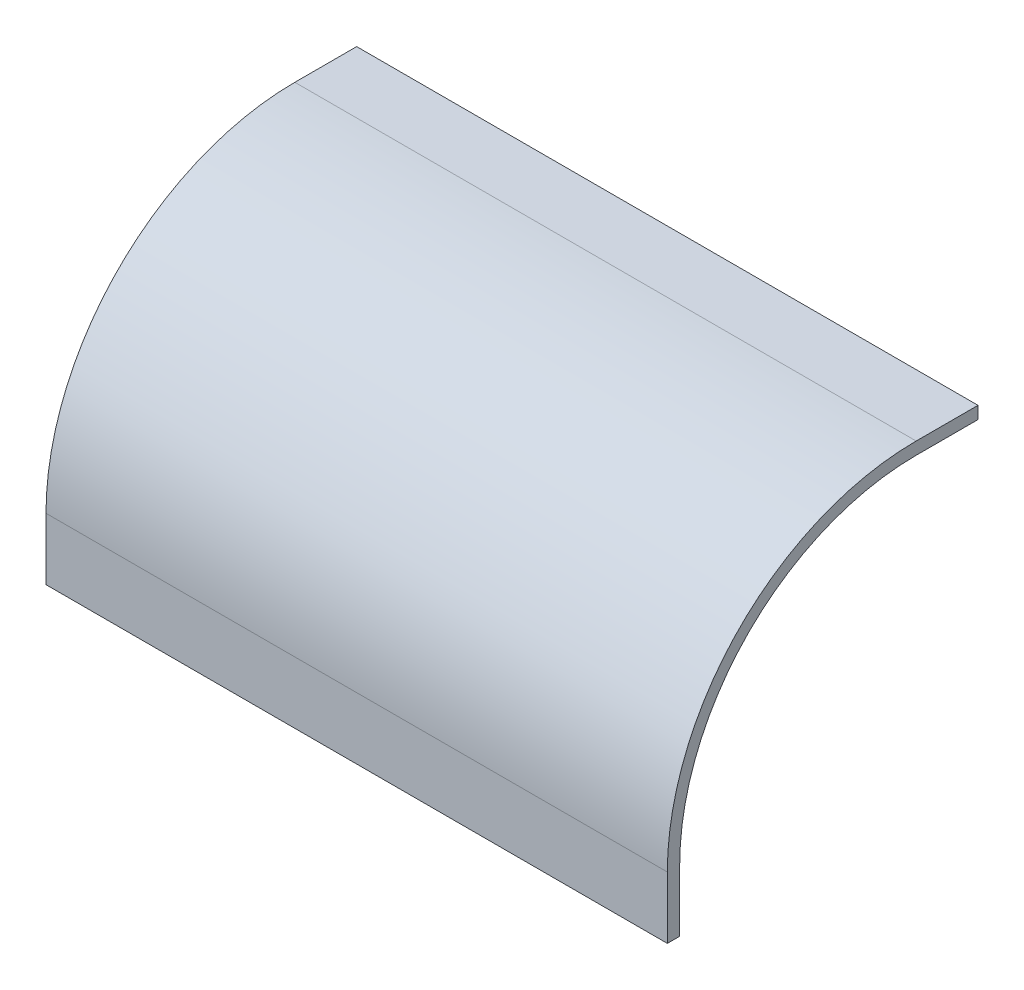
ISO-10303-21;
HEADER;
FILE_DESCRIPTION(('STEP AP214'),'2;1');
FILE_NAME('part.step','',(''),(''),'','','');
FILE_SCHEMA(('AUTOMOTIVE_DESIGN { 1 0 10303 214 1 1 1 1 }'));
ENDSEC;
DATA;
#1=APPLICATION_CONTEXT('core data for automotive mechanical design processes');
#2=APPLICATION_PROTOCOL_DEFINITION('international standard','automotive_design',2000,#1);
#3=PRODUCT_CONTEXT('',#1,'mechanical');
#4=PRODUCT('Part','Part','',(#3));
#5=PRODUCT_RELATED_PRODUCT_CATEGORY('part','',(#4));
#6=PRODUCT_DEFINITION_FORMATION('','',#4);
#7=PRODUCT_DEFINITION_CONTEXT('part definition',#1,'design');
#8=PRODUCT_DEFINITION('design','',#6,#7);
#9=PRODUCT_DEFINITION_SHAPE('','',#8);
#10=(LENGTH_UNIT() NAMED_UNIT(*) SI_UNIT(.MILLI.,.METRE.));
#11=(NAMED_UNIT(*) PLANE_ANGLE_UNIT() SI_UNIT($,.RADIAN.));
#12=(NAMED_UNIT(*) SI_UNIT($,.STERADIAN.) SOLID_ANGLE_UNIT());
#13=UNCERTAINTY_MEASURE_WITH_UNIT(LENGTH_MEASURE(1.E-05),#10,'distance_accuracy_value','');
#14=(GEOMETRIC_REPRESENTATION_CONTEXT(3) GLOBAL_UNCERTAINTY_ASSIGNED_CONTEXT((#13)) GLOBAL_UNIT_ASSIGNED_CONTEXT((#10,
#11,#12)) REPRESENTATION_CONTEXT('',''));
#15=CARTESIAN_POINT('',(0.,0.,0.));
#16=DIRECTION('',(0.,0.,1.));
#17=DIRECTION('',(1.,0.,0.));
#18=AXIS2_PLACEMENT_3D('',#15,#16,#17);
#19=CARTESIAN_POINT('',(0.,250.,-200.));
#20=DIRECTION('',(0.,-1.,0.));
#21=DIRECTION('',(1.,0.,0.));
#22=AXIS2_PLACEMENT_3D('',#19,#20,#21);
#23=PLANE('',#22);
#24=DIRECTION('',(-1.,0.,0.));
#25=VECTOR('',#24,1.);
#26=CARTESIAN_POINT('',(0.,250.,-200.));
#27=LINE('',#26,#25);
#28=CARTESIAN_POINT('',(0.,250.,-200.));
#29=VERTEX_POINT('',#28);
#30=CARTESIAN_POINT('',(-500.,250.,-200.));
#31=VERTEX_POINT('',#30);
#32=EDGE_CURVE('E152',#29,#31,#27,.T.);
#33=ORIENTED_EDGE('',*,*,#32,.T.);
#34=DIRECTION('',(0.,0.,-1.));
#35=VECTOR('',#34,1.);
#36=CARTESIAN_POINT('',(-500.,250.,-200.));
#37=LINE('',#36,#35);
#38=CARTESIAN_POINT('',(-500.,250.,-250.));
#39=VERTEX_POINT('',#38);
#40=EDGE_CURVE('E38',#31,#39,#37,.T.);
#41=ORIENTED_EDGE('',*,*,#40,.T.);
#42=DIRECTION('',(-1.,0.,0.));
#43=VECTOR('',#42,1.);
#44=CARTESIAN_POINT('',(0.,250.,-250.));
#45=LINE('',#44,#43);
#46=CARTESIAN_POINT('',(0.,250.,-250.));
#47=VERTEX_POINT('',#46);
#48=EDGE_CURVE('E45',#47,#39,#45,.T.);
#49=ORIENTED_EDGE('',*,*,#48,.F.);
#50=DIRECTION('',(0.,0.,-1.));
#51=VECTOR('',#50,1.);
#52=CARTESIAN_POINT('',(0.,250.,-200.));
#53=LINE('',#52,#51);
#54=EDGE_CURVE('E11',#29,#47,#53,.T.);
#55=ORIENTED_EDGE('',*,*,#54,.F.);
#56=EDGE_LOOP('',(#33,#41,#49,#55));
#57=FACE_BOUND('',#56,.T.);
#58=ADVANCED_FACE('F31',(#57),#23,.T.);
#59=CARTESIAN_POINT('',(-500.,241.214,-200.));
#60=DIRECTION('',(0.,-1.,0.));
#61=DIRECTION('',(0.,0.,-1.));
#62=AXIS2_PLACEMENT_3D('',#59,#60,#61);
#63=PLANE('',#62);
#64=DIRECTION('',(-1.,0.,0.));
#65=VECTOR('',#64,1.);
#66=CARTESIAN_POINT('',(-500.,241.214,-200.));
#67=LINE('',#66,#65);
#68=CARTESIAN_POINT('',(-500.,241.214,-200.));
#69=VERTEX_POINT('',#68);
#70=CARTESIAN_POINT('',(-501.214,241.214,-200.));
#71=VERTEX_POINT('',#70);
#72=EDGE_CURVE('E183',#69,#71,#67,.T.);
#73=ORIENTED_EDGE('',*,*,#72,.T.);
#74=DIRECTION('',(0.,0.,-1.));
#75=VECTOR('',#74,1.);
#76=CARTESIAN_POINT('',(-501.214,241.214,-200.));
#77=LINE('',#76,#75);
#78=CARTESIAN_POINT('',(-501.214,241.214,-250.));
#79=VERTEX_POINT('',#78);
#80=EDGE_CURVE('E236',#71,#79,#77,.T.);
#81=ORIENTED_EDGE('',*,*,#80,.T.);
#82=DIRECTION('',(-1.,0.,0.));
#83=VECTOR('',#82,1.);
#84=CARTESIAN_POINT('',(-500.,241.214,-250.));
#85=LINE('',#84,#83);
#86=CARTESIAN_POINT('',(-500.,241.214,-250.));
#87=VERTEX_POINT('',#86);
#88=EDGE_CURVE('E219',#87,#79,#85,.T.);
#89=ORIENTED_EDGE('',*,*,#88,.F.);
#90=DIRECTION('',(0.,0.,-1.));
#91=VECTOR('',#90,1.);
#92=CARTESIAN_POINT('',(-500.,241.214,-200.));
#93=LINE('',#92,#91);
#94=EDGE_CURVE('E239',#69,#87,#93,.T.);
#95=ORIENTED_EDGE('',*,*,#94,.F.);
#96=EDGE_LOOP('',(#73,#81,#89,#95));
#97=FACE_BOUND('',#96,.T.);
#98=ADVANCED_FACE('F286',(#97),#63,.T.);
#99=CARTESIAN_POINT('',(1.214,251.214,-200.));
#100=DIRECTION('',(0.,1.,0.));
#101=DIRECTION('',(-1.,0.,0.));
#102=AXIS2_PLACEMENT_3D('',#99,#100,#101);
#103=PLANE('',#102);
#104=DIRECTION('',(1.,0.,0.));
#105=VECTOR('',#104,1.);
#106=CARTESIAN_POINT('',(1.214,251.214,-200.));
#107=LINE('',#106,#105);
#108=CARTESIAN_POINT('',(-501.214,251.214,-200.));
#109=VERTEX_POINT('',#108);
#110=CARTESIAN_POINT('',(1.214,251.214,-200.));
#111=VERTEX_POINT('',#110);
#112=EDGE_CURVE('E175',#109,#111,#107,.T.);
#113=ORIENTED_EDGE('',*,*,#112,.T.);
#114=DIRECTION('',(0.,0.,-1.));
#115=VECTOR('',#114,1.);
#116=CARTESIAN_POINT('',(1.214,251.214,-200.));
#117=LINE('',#116,#115);
#118=CARTESIAN_POINT('',(1.214,251.214,-250.));
#119=VERTEX_POINT('',#118);
#120=EDGE_CURVE('E230',#111,#119,#117,.T.);
#121=ORIENTED_EDGE('',*,*,#120,.T.);
#122=DIRECTION('',(1.,0.,0.));
#123=VECTOR('',#122,1.);
#124=CARTESIAN_POINT('',(1.214,251.214,-250.));
#125=LINE('',#124,#123);
#126=CARTESIAN_POINT('',(-501.214,251.214,-250.));
#127=VERTEX_POINT('',#126);
#128=EDGE_CURVE('E213',#127,#119,#125,.T.);
#129=ORIENTED_EDGE('',*,*,#128,.F.);
#130=DIRECTION('',(0.,0.,-1.));
#131=VECTOR('',#130,1.);
#132=CARTESIAN_POINT('',(-501.214,251.214,-200.));
#133=LINE('',#132,#131);
#134=EDGE_CURVE('E233',#109,#127,#133,.T.);
#135=ORIENTED_EDGE('',*,*,#134,.F.);
#136=EDGE_LOOP('',(#113,#121,#129,#135));
#137=FACE_BOUND('',#136,.T.);
#138=ADVANCED_FACE('F321',(#137),#103,.T.);
#139=CARTESIAN_POINT('',(0.,241.214,-200.));
#140=DIRECTION('',(0.,-1.,0.));
#141=DIRECTION('',(0.,0.,-1.));
#142=AXIS2_PLACEMENT_3D('',#139,#140,#141);
#143=PLANE('',#142);
#144=DIRECTION('',(-1.,0.,0.));
#145=VECTOR('',#144,1.);
#146=CARTESIAN_POINT('',(0.,241.214,-200.));
#147=LINE('',#146,#145);
#148=CARTESIAN_POINT('',(1.214,241.214,-200.));
#149=VERTEX_POINT('',#148);
#150=CARTESIAN_POINT('',(0.,241.214,-200.));
#151=VERTEX_POINT('',#150);
#152=EDGE_CURVE('E172',#149,#151,#147,.T.);
#153=ORIENTED_EDGE('',*,*,#152,.T.);
#154=DIRECTION('',(0.,0.,-1.));
#155=VECTOR('',#154,1.);
#156=CARTESIAN_POINT('',(0.,241.214,-200.));
#157=LINE('',#156,#155);
#158=CARTESIAN_POINT('',(0.,241.214,-250.));
#159=VERTEX_POINT('',#158);
#160=EDGE_CURVE('E224',#151,#159,#157,.T.);
#161=ORIENTED_EDGE('',*,*,#160,.T.);
#162=DIRECTION('',(-1.,0.,0.));
#163=VECTOR('',#162,1.);
#164=CARTESIAN_POINT('',(0.,241.214,-250.));
#165=LINE('',#164,#163);
#166=CARTESIAN_POINT('',(1.214,241.214,-250.));
#167=VERTEX_POINT('',#166);
#168=EDGE_CURVE('E207',#167,#159,#165,.T.);
#169=ORIENTED_EDGE('',*,*,#168,.F.);
#170=DIRECTION('',(0.,0.,-1.));
#171=VECTOR('',#170,1.);
#172=CARTESIAN_POINT('',(1.214,241.214,-200.));
#173=LINE('',#172,#171);
#174=EDGE_CURVE('E227',#149,#167,#173,.T.);
#175=ORIENTED_EDGE('',*,*,#174,.F.);
#176=EDGE_LOOP('',(#153,#161,#169,#175));
#177=FACE_BOUND('',#176,.T.);
#178=ADVANCED_FACE('F292',(#177),#143,.T.);
#179=CARTESIAN_POINT('',(0.,50.,-200.));
#180=DIRECTION('',(-1.,0.,0.));
#181=DIRECTION('',(0.,0.,1.));
#182=AXIS2_PLACEMENT_3D('',#179,#180,#181);
#183=CYLINDRICAL_SURFACE('',#182,200.);
#184=DIRECTION('',(-1.,0.,0.));
#185=VECTOR('',#184,1.);
#186=CARTESIAN_POINT('',(0.,50.,0.));
#187=LINE('',#186,#185);
#188=CARTESIAN_POINT('',(0.,50.,0.));
#189=VERTEX_POINT('',#188);
#190=CARTESIAN_POINT('',(-500.,50.,0.));
#191=VERTEX_POINT('',#190);
#192=EDGE_CURVE('E149',#189,#191,#187,.T.);
#193=ORIENTED_EDGE('',*,*,#192,.T.);
#194=CARTESIAN_POINT('',(-500.,50.,-200.));
#195=DIRECTION('',(-1.,0.,0.));
#196=DIRECTION('',(0.,0.,1.));
#197=AXIS2_PLACEMENT_3D('',#194,#195,#196);
#198=CIRCLE('',#197,200.);
#199=EDGE_CURVE('E156',#191,#31,#198,.T.);
#200=ORIENTED_EDGE('',*,*,#199,.T.);
#201=ORIENTED_EDGE('',*,*,#32,.F.);
#202=CARTESIAN_POINT('',(0.,50.,-200.));
#203=DIRECTION('',(-1.,0.,0.));
#204=DIRECTION('',(0.,0.,1.));
#205=AXIS2_PLACEMENT_3D('',#202,#203,#204);
#206=CIRCLE('',#205,200.);
#207=EDGE_CURVE('E145',#189,#29,#206,.T.);
#208=ORIENTED_EDGE('',*,*,#207,.F.);
#209=EDGE_LOOP('',(#193,#200,#201,#208));
#210=FACE_BOUND('',#209,.T.);
#211=ADVANCED_FACE('F147',(#210),#183,.F.);
#212=CARTESIAN_POINT('',(0.,50.,-200.));
#213=DIRECTION('',(-1.,0.,0.));
#214=DIRECTION('',(0.,0.,1.));
#215=AXIS2_PLACEMENT_3D('',#212,#213,#214);
#216=CYLINDRICAL_SURFACE('',#215,191.214);
#217=DIRECTION('',(-1.,0.,0.));
#218=VECTOR('',#217,1.);
#219=CARTESIAN_POINT('',(-500.,50.,-8.78599999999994));
#220=LINE('',#219,#218);
#221=CARTESIAN_POINT('',(-500.,50.,-8.78599999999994));
#222=VERTEX_POINT('',#221);
#223=CARTESIAN_POINT('',(-501.214,50.,-8.78599999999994));
#224=VERTEX_POINT('',#223);
#225=EDGE_CURVE('E165',#222,#224,#220,.T.);
#226=ORIENTED_EDGE('',*,*,#225,.T.);
#227=CARTESIAN_POINT('',(-501.214,50.,-200.));
#228=DIRECTION('',(-1.,0.,0.));
#229=DIRECTION('',(0.,0.,1.));
#230=AXIS2_PLACEMENT_3D('',#227,#228,#229);
#231=CIRCLE('',#230,191.214);
#232=EDGE_CURVE('E199',#224,#71,#231,.T.);
#233=ORIENTED_EDGE('',*,*,#232,.T.);
#234=ORIENTED_EDGE('',*,*,#72,.F.);
#235=CARTESIAN_POINT('',(-500.,50.,-200.));
#236=DIRECTION('',(-1.,0.,0.));
#237=DIRECTION('',(0.,0.,1.));
#238=AXIS2_PLACEMENT_3D('',#235,#236,#237);
#239=CIRCLE('',#238,191.214);
#240=EDGE_CURVE('E202',#222,#69,#239,.T.);
#241=ORIENTED_EDGE('',*,*,#240,.F.);
#242=EDGE_LOOP('',(#226,#233,#234,#241));
#243=FACE_BOUND('',#242,.T.);
#244=ADVANCED_FACE('F284',(#243),#216,.F.);
#245=CARTESIAN_POINT('',(0.,50.,-200.));
#246=DIRECTION('',(-1.,0.,0.));
#247=DIRECTION('',(0.,0.,1.));
#248=AXIS2_PLACEMENT_3D('',#245,#246,#247);
#249=CYLINDRICAL_SURFACE('',#248,201.214);
#250=DIRECTION('',(1.,0.,0.));
#251=VECTOR('',#250,1.);
#252=CARTESIAN_POINT('',(1.214,50.,1.214));
#253=LINE('',#252,#251);
#254=CARTESIAN_POINT('',(-501.214,50.,1.21400000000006));
#255=VERTEX_POINT('',#254);
#256=CARTESIAN_POINT('',(1.214,50.,1.214));
#257=VERTEX_POINT('',#256);
#258=EDGE_CURVE('E299',#255,#257,#253,.T.);
#259=ORIENTED_EDGE('',*,*,#258,.T.);
#260=CARTESIAN_POINT('',(1.214,50.,-200.));
#261=DIRECTION('',(-1.,0.,0.));
#262=DIRECTION('',(0.,0.,1.));
#263=AXIS2_PLACEMENT_3D('',#260,#261,#262);
#264=CIRCLE('',#263,201.214);
#265=EDGE_CURVE('E193',#257,#111,#264,.T.);
#266=ORIENTED_EDGE('',*,*,#265,.T.);
#267=ORIENTED_EDGE('',*,*,#112,.F.);
#268=CARTESIAN_POINT('',(-501.214,50.,-200.));
#269=DIRECTION('',(-1.,0.,0.));
#270=DIRECTION('',(0.,0.,1.));
#271=AXIS2_PLACEMENT_3D('',#268,#269,#270);
#272=CIRCLE('',#271,201.214);
#273=EDGE_CURVE('E196',#255,#109,#272,.T.);
#274=ORIENTED_EDGE('',*,*,#273,.F.);
#275=EDGE_LOOP('',(#259,#266,#267,#274));
#276=FACE_BOUND('',#275,.T.);
#277=ADVANCED_FACE('F310',(#276),#249,.T.);
#278=CARTESIAN_POINT('',(0.,50.,-200.));
#279=DIRECTION('',(-1.,0.,0.));
#280=DIRECTION('',(0.,0.,1.));
#281=AXIS2_PLACEMENT_3D('',#278,#279,#280);
#282=CYLINDRICAL_SURFACE('',#281,191.214);
#283=DIRECTION('',(-1.,0.,0.));
#284=VECTOR('',#283,1.);
#285=CARTESIAN_POINT('',(0.,50.,-8.786));
#286=LINE('',#285,#284);
#287=CARTESIAN_POINT('',(1.214,50.,-8.786));
#288=VERTEX_POINT('',#287);
#289=CARTESIAN_POINT('',(0.,50.,-8.786));
#290=VERTEX_POINT('',#289);
#291=EDGE_CURVE('E266',#288,#290,#286,.T.);
#292=ORIENTED_EDGE('',*,*,#291,.T.);
#293=CARTESIAN_POINT('',(0.,50.,-200.));
#294=DIRECTION('',(-1.,0.,0.));
#295=DIRECTION('',(0.,0.,1.));
#296=AXIS2_PLACEMENT_3D('',#293,#294,#295);
#297=CIRCLE('',#296,191.214);
#298=EDGE_CURVE('E187',#290,#151,#297,.T.);
#299=ORIENTED_EDGE('',*,*,#298,.T.);
#300=ORIENTED_EDGE('',*,*,#152,.F.);
#301=CARTESIAN_POINT('',(1.214,50.,-200.));
#302=DIRECTION('',(-1.,0.,0.));
#303=DIRECTION('',(0.,0.,1.));
#304=AXIS2_PLACEMENT_3D('',#301,#302,#303);
#305=CIRCLE('',#304,191.214);
#306=EDGE_CURVE('E190',#288,#149,#305,.T.);
#307=ORIENTED_EDGE('',*,*,#306,.F.);
#308=EDGE_LOOP('',(#292,#299,#300,#307));
#309=FACE_BOUND('',#308,.T.);
#310=ADVANCED_FACE('F294',(#309),#282,.F.);
#311=CARTESIAN_POINT('',(0.,50.,0.));
#312=DIRECTION('',(1.,0.,0.));
#313=DIRECTION('',(0.,0.,-1.));
#314=AXIS2_PLACEMENT_3D('',#311,#312,#313);
#315=PLANE('',#314);
#316=DIRECTION('',(0.,0.,1.));
#317=VECTOR('',#316,1.);
#318=CARTESIAN_POINT('',(0.,0.,0.));
#319=LINE('',#318,#317);
#320=CARTESIAN_POINT('',(0.,0.,-8.786));
#321=VERTEX_POINT('',#320);
#322=CARTESIAN_POINT('',(0.,0.,0.));
#323=VERTEX_POINT('',#322);
#324=EDGE_CURVE('E171',#321,#323,#319,.T.);
#325=ORIENTED_EDGE('',*,*,#324,.T.);
#326=DIRECTION('',(0.,-1.,0.));
#327=VECTOR('',#326,1.);
#328=CARTESIAN_POINT('',(0.,50.,0.));
#329=LINE('',#328,#327);
#330=EDGE_CURVE('E161',#189,#323,#329,.T.);
#331=ORIENTED_EDGE('',*,*,#330,.F.);
#332=ORIENTED_EDGE('',*,*,#207,.T.);
#333=ORIENTED_EDGE('',*,*,#54,.T.);
#334=DIRECTION('',(0.,1.,0.));
#335=VECTOR('',#334,1.);
#336=CARTESIAN_POINT('',(0.,250.,-250.));
#337=LINE('',#336,#335);
#338=EDGE_CURVE('E155',#159,#47,#337,.T.);
#339=ORIENTED_EDGE('',*,*,#338,.F.);
#340=ORIENTED_EDGE('',*,*,#160,.F.);
#341=ORIENTED_EDGE('',*,*,#298,.F.);
#342=DIRECTION('',(0.,-1.,0.));
#343=VECTOR('',#342,1.);
#344=CARTESIAN_POINT('',(0.,50.,-8.786));
#345=LINE('',#344,#343);
#346=EDGE_CURVE('E263',#290,#321,#345,.T.);
#347=ORIENTED_EDGE('',*,*,#346,.T.);
#348=EDGE_LOOP('',(#325,#331,#332,#333,#339,#340,#341,#347));
#349=FACE_BOUND('',#348,.T.);
#350=ADVANCED_FACE('F168',(#349),#315,.F.);
#351=CARTESIAN_POINT('',(0.,50.,0.));
#352=DIRECTION('',(0.,0.,1.));
#353=DIRECTION('',(1.,0.,0.));
#354=AXIS2_PLACEMENT_3D('',#351,#352,#353);
#355=PLANE('',#354);
#356=DIRECTION('',(-1.,0.,0.));
#357=VECTOR('',#356,1.);
#358=CARTESIAN_POINT('',(0.,0.,0.));
#359=LINE('',#358,#357);
#360=CARTESIAN_POINT('',(-500.,0.,0.));
#361=VERTEX_POINT('',#360);
#362=EDGE_CURVE('E248',#323,#361,#359,.T.);
#363=ORIENTED_EDGE('',*,*,#362,.T.);
#364=DIRECTION('',(0.,-1.,0.));
#365=VECTOR('',#364,1.);
#366=CARTESIAN_POINT('',(-500.,50.,0.));
#367=LINE('',#366,#365);
#368=EDGE_CURVE('E164',#191,#361,#367,.T.);
#369=ORIENTED_EDGE('',*,*,#368,.F.);
#370=ORIENTED_EDGE('',*,*,#192,.F.);
#371=ORIENTED_EDGE('',*,*,#330,.T.);
#372=EDGE_LOOP('',(#363,#369,#370,#371));
#373=FACE_BOUND('',#372,.T.);
#374=ADVANCED_FACE('F160',(#373),#355,.F.);
#375=CARTESIAN_POINT('',(-500.,50.,0.));
#376=DIRECTION('',(-1.,0.,0.));
#377=DIRECTION('',(0.,0.,1.));
#378=AXIS2_PLACEMENT_3D('',#375,#376,#377);
#379=PLANE('',#378);
#380=DIRECTION('',(0.,0.,-1.));
#381=VECTOR('',#380,1.);
#382=CARTESIAN_POINT('',(-500.,0.,0.));
#383=LINE('',#382,#381);
#384=CARTESIAN_POINT('',(-500.,0.,-8.78599999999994));
#385=VERTEX_POINT('',#384);
#386=EDGE_CURVE('E243',#361,#385,#383,.T.);
#387=ORIENTED_EDGE('',*,*,#386,.T.);
#388=DIRECTION('',(0.,-1.,0.));
#389=VECTOR('',#388,1.);
#390=CARTESIAN_POINT('',(-500.,50.,-8.78599999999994));
#391=LINE('',#390,#389);
#392=EDGE_CURVE('E177',#222,#385,#391,.T.);
#393=ORIENTED_EDGE('',*,*,#392,.F.);
#394=ORIENTED_EDGE('',*,*,#240,.T.);
#395=ORIENTED_EDGE('',*,*,#94,.T.);
#396=DIRECTION('',(0.,-1.,0.));
#397=VECTOR('',#396,1.);
#398=CARTESIAN_POINT('',(-500.,250.,-250.));
#399=LINE('',#398,#397);
#400=EDGE_CURVE('E53',#39,#87,#399,.T.);
#401=ORIENTED_EDGE('',*,*,#400,.F.);
#402=ORIENTED_EDGE('',*,*,#40,.F.);
#403=ORIENTED_EDGE('',*,*,#199,.F.);
#404=ORIENTED_EDGE('',*,*,#368,.T.);
#405=EDGE_LOOP('',(#387,#393,#394,#395,#401,#402,#403,#404));
#406=FACE_BOUND('',#405,.T.);
#407=ADVANCED_FACE('F240',(#406),#379,.F.);
#408=CARTESIAN_POINT('',(-500.,50.,-8.78599999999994));
#409=DIRECTION('',(0.,0.,1.));
#410=DIRECTION('',(1.,0.,0.));
#411=AXIS2_PLACEMENT_3D('',#408,#409,#410);
#412=PLANE('',#411);
#413=DIRECTION('',(-1.,0.,0.));
#414=VECTOR('',#413,1.);
#415=CARTESIAN_POINT('',(-500.,0.,-8.78599999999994));
#416=LINE('',#415,#414);
#417=CARTESIAN_POINT('',(-501.214,0.,-8.78599999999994));
#418=VERTEX_POINT('',#417);
#419=EDGE_CURVE('E250',#385,#418,#416,.T.);
#420=ORIENTED_EDGE('',*,*,#419,.T.);
#421=DIRECTION('',(0.,-1.,0.));
#422=VECTOR('',#421,1.);
#423=CARTESIAN_POINT('',(-501.214,50.,-8.78599999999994));
#424=LINE('',#423,#422);
#425=EDGE_CURVE('E275',#224,#418,#424,.T.);
#426=ORIENTED_EDGE('',*,*,#425,.F.);
#427=ORIENTED_EDGE('',*,*,#225,.F.);
#428=ORIENTED_EDGE('',*,*,#392,.T.);
#429=EDGE_LOOP('',(#420,#426,#427,#428));
#430=FACE_BOUND('',#429,.T.);
#431=ADVANCED_FACE('F279',(#430),#412,.F.);
#432=CARTESIAN_POINT('',(-501.214,50.,1.21400000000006));
#433=DIRECTION('',(1.,0.,0.));
#434=DIRECTION('',(0.,0.,-1.));
#435=AXIS2_PLACEMENT_3D('',#432,#433,#434);
#436=PLANE('',#435);
#437=DIRECTION('',(0.,0.,1.));
#438=VECTOR('',#437,1.);
#439=CARTESIAN_POINT('',(-501.214,0.,1.21400000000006));
#440=LINE('',#439,#438);
#441=CARTESIAN_POINT('',(-501.214,0.,1.21400000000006));
#442=VERTEX_POINT('',#441);
#443=EDGE_CURVE('E252',#418,#442,#440,.T.);
#444=ORIENTED_EDGE('',*,*,#443,.T.);
#445=DIRECTION('',(0.,-1.,0.));
#446=VECTOR('',#445,1.);
#447=CARTESIAN_POINT('',(-501.214,50.,1.21400000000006));
#448=LINE('',#447,#446);
#449=EDGE_CURVE('E272',#255,#442,#448,.T.);
#450=ORIENTED_EDGE('',*,*,#449,.F.);
#451=ORIENTED_EDGE('',*,*,#273,.T.);
#452=ORIENTED_EDGE('',*,*,#134,.T.);
#453=DIRECTION('',(0.,1.,0.));
#454=VECTOR('',#453,1.);
#455=CARTESIAN_POINT('',(-501.214,251.214,-250.));
#456=LINE('',#455,#454);
#457=EDGE_CURVE('E216',#79,#127,#456,.T.);
#458=ORIENTED_EDGE('',*,*,#457,.F.);
#459=ORIENTED_EDGE('',*,*,#80,.F.);
#460=ORIENTED_EDGE('',*,*,#232,.F.);
#461=ORIENTED_EDGE('',*,*,#425,.T.);
#462=EDGE_LOOP('',(#444,#450,#451,#452,#458,#459,#460,#461));
#463=FACE_BOUND('',#462,.T.);
#464=ADVANCED_FACE('F319',(#463),#436,.F.);
#465=CARTESIAN_POINT('',(1.214,50.,1.214));
#466=DIRECTION('',(0.,0.,-1.));
#467=DIRECTION('',(-1.,0.,0.));
#468=AXIS2_PLACEMENT_3D('',#465,#466,#467);
#469=PLANE('',#468);
#470=DIRECTION('',(1.,0.,0.));
#471=VECTOR('',#470,1.);
#472=CARTESIAN_POINT('',(1.214,0.,1.214));
#473=LINE('',#472,#471);
#474=CARTESIAN_POINT('',(1.214,0.,1.214));
#475=VERTEX_POINT('',#474);
#476=EDGE_CURVE('E258',#442,#475,#473,.T.);
#477=ORIENTED_EDGE('',*,*,#476,.T.);
#478=DIRECTION('',(0.,-1.,0.));
#479=VECTOR('',#478,1.);
#480=CARTESIAN_POINT('',(1.214,50.,1.214));
#481=LINE('',#480,#479);
#482=EDGE_CURVE('E269',#257,#475,#481,.T.);
#483=ORIENTED_EDGE('',*,*,#482,.F.);
#484=ORIENTED_EDGE('',*,*,#258,.F.);
#485=ORIENTED_EDGE('',*,*,#449,.T.);
#486=EDGE_LOOP('',(#477,#483,#484,#485));
#487=FACE_BOUND('',#486,.T.);
#488=ADVANCED_FACE('F314',(#487),#469,.F.);
#489=CARTESIAN_POINT('',(1.214,50.,1.214));
#490=DIRECTION('',(-1.,0.,0.));
#491=DIRECTION('',(0.,0.,1.));
#492=AXIS2_PLACEMENT_3D('',#489,#490,#491);
#493=PLANE('',#492);
#494=DIRECTION('',(0.,0.,-1.));
#495=VECTOR('',#494,1.);
#496=CARTESIAN_POINT('',(1.214,0.,1.214));
#497=LINE('',#496,#495);
#498=CARTESIAN_POINT('',(1.214,0.,-8.786));
#499=VERTEX_POINT('',#498);
#500=EDGE_CURVE('E260',#475,#499,#497,.T.);
#501=ORIENTED_EDGE('',*,*,#500,.T.);
#502=DIRECTION('',(0.,-1.,0.));
#503=VECTOR('',#502,1.);
#504=CARTESIAN_POINT('',(1.214,50.,-8.786));
#505=LINE('',#504,#503);
#506=EDGE_CURVE('E265',#288,#499,#505,.T.);
#507=ORIENTED_EDGE('',*,*,#506,.F.);
#508=ORIENTED_EDGE('',*,*,#306,.T.);
#509=ORIENTED_EDGE('',*,*,#174,.T.);
#510=DIRECTION('',(0.,-1.,0.));
#511=VECTOR('',#510,1.);
#512=CARTESIAN_POINT('',(1.214,251.214,-250.));
#513=LINE('',#512,#511);
#514=EDGE_CURVE('E210',#119,#167,#513,.T.);
#515=ORIENTED_EDGE('',*,*,#514,.F.);
#516=ORIENTED_EDGE('',*,*,#120,.F.);
#517=ORIENTED_EDGE('',*,*,#265,.F.);
#518=ORIENTED_EDGE('',*,*,#482,.T.);
#519=EDGE_LOOP('',(#501,#507,#508,#509,#515,#516,#517,#518));
#520=FACE_BOUND('',#519,.T.);
#521=ADVANCED_FACE('F317',(#520),#493,.F.);
#522=CARTESIAN_POINT('',(0.,50.,-8.786));
#523=DIRECTION('',(0.,0.,1.));
#524=DIRECTION('',(1.,0.,0.));
#525=AXIS2_PLACEMENT_3D('',#522,#523,#524);
#526=PLANE('',#525);
#527=DIRECTION('',(-1.,0.,0.));
#528=VECTOR('',#527,1.);
#529=CARTESIAN_POINT('',(0.,0.,-8.786));
#530=LINE('',#529,#528);
#531=EDGE_CURVE('E166',#499,#321,#530,.T.);
#532=ORIENTED_EDGE('',*,*,#531,.T.);
#533=ORIENTED_EDGE('',*,*,#346,.F.);
#534=ORIENTED_EDGE('',*,*,#291,.F.);
#535=ORIENTED_EDGE('',*,*,#506,.T.);
#536=EDGE_LOOP('',(#532,#533,#534,#535));
#537=FACE_BOUND('',#536,.T.);
#538=ADVANCED_FACE('F301',(#537),#526,.F.);
#539=CARTESIAN_POINT('',(0.,241.214,-250.));
#540=DIRECTION('',(0.,0.,1.));
#541=DIRECTION('',(0.,-1.,0.));
#542=AXIS2_PLACEMENT_3D('',#539,#540,#541);
#543=PLANE('',#542);
#544=ORIENTED_EDGE('',*,*,#338,.T.);
#545=ORIENTED_EDGE('',*,*,#48,.T.);
#546=ORIENTED_EDGE('',*,*,#400,.T.);
#547=ORIENTED_EDGE('',*,*,#88,.T.);
#548=ORIENTED_EDGE('',*,*,#457,.T.);
#549=ORIENTED_EDGE('',*,*,#128,.T.);
#550=ORIENTED_EDGE('',*,*,#514,.T.);
#551=ORIENTED_EDGE('',*,*,#168,.T.);
#552=EDGE_LOOP('',(#544,#545,#546,#547,#548,#549,#550,#551));
#553=FACE_BOUND('',#552,.T.);
#554=ADVANCED_FACE('F288',(#553),#543,.F.);
#555=CARTESIAN_POINT('',(0.,0.,-8.786));
#556=DIRECTION('',(0.,-1.,0.));
#557=DIRECTION('',(0.,0.,-1.));
#558=AXIS2_PLACEMENT_3D('',#555,#556,#557);
#559=PLANE('',#558);
#560=ORIENTED_EDGE('',*,*,#324,.F.);
#561=ORIENTED_EDGE('',*,*,#531,.F.);
#562=ORIENTED_EDGE('',*,*,#500,.F.);
#563=ORIENTED_EDGE('',*,*,#476,.F.);
#564=ORIENTED_EDGE('',*,*,#443,.F.);
#565=ORIENTED_EDGE('',*,*,#419,.F.);
#566=ORIENTED_EDGE('',*,*,#386,.F.);
#567=ORIENTED_EDGE('',*,*,#362,.F.);
#568=EDGE_LOOP('',(#560,#561,#562,#563,#564,#565,#566,#567));
#569=FACE_BOUND('',#568,.T.);
#570=ADVANCED_FACE('F247',(#569),#559,.T.);
#571=CLOSED_SHELL('',(#58,#98,#138,#178,#211,#244,#277,#310,#350,#374,#407,#431,#464,#488,#521,
#538,#554,#570));
#572=MANIFOLD_SOLID_BREP('B2',#571);
#573=ADVANCED_BREP_SHAPE_REPRESENTATION('',(#18,#572),#14);
#574=SHAPE_DEFINITION_REPRESENTATION(#9,#573);
ENDSEC;
END-ISO-10303-21;
